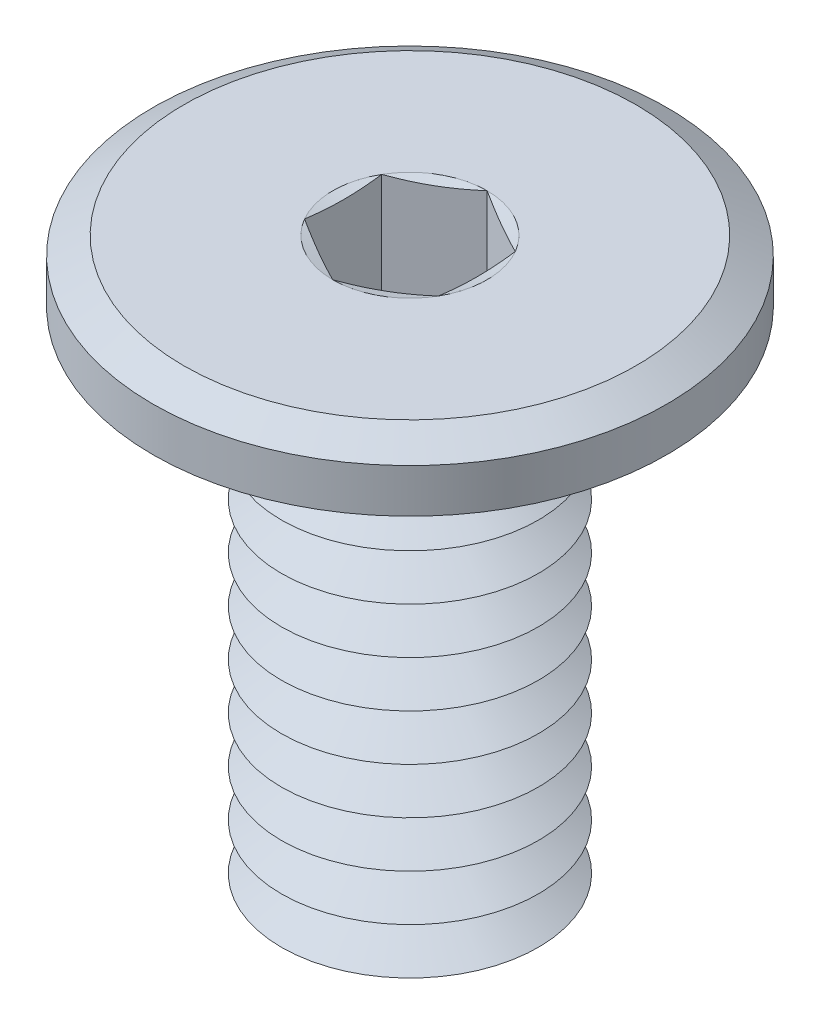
from build123d import *

# Parameters (mm, degrees)
SKETCH1_R           = 2.5
BOSS_EXTRUDE1_DEPTH = 0.6
SKETCH2_R           = 1.25
BOSS_EXTRUDE2_DEPTH = 5
LPATTERN1_COUNT     = 10
LPATTERN1_PITCH     = 0.45
FILLET1_R           = 0.1
CHAMFER2_SIZE       = 0.3
CHAMFER2_SIZE2      = 0.173205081
CUT_EXTRUDE1_DEPTH  = 1.2


with BuildPart() as part:
    # Sketch1 → Boss-Extrude1 (new body)
    with BuildSketch(Plane(origin=(0, 0, 0), x_dir=(1, 0, 0), z_dir=(0, 1, 0))):
        with Locations(Location((0, 0, 0), (0, 0, 270))):
            Circle(SKETCH1_R)
    extrude(amount=-BOSS_EXTRUDE1_DEPTH)

    # Sketch2 → Boss-Extrude2 (add)
    with BuildSketch(Plane.XZ.offset(0.6)):
        with Locations(Location((0, 0, 0), (0, 0, 270))):
            Circle(SKETCH2_R)
    extrude(amount=BOSS_EXTRUDE2_DEPTH)

    # Sketch5 → Cut-Revolve1 (revolve, cut)
    with BuildSketch(Plane(origin=(0, 0, 0), x_dir=(0, 0, -1), z_dir=(1, 0, 0))):
        Polygon((-1.25, -5.825), (-0.860288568, -5.6), (-1.25, -5.375), align=None)
    cut_revolve1 = revolve(axis=Axis((0, 0.990593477, 0), (0, -1, 0)), mode=Mode.SUBTRACT)

    # LPattern1: Cut-Revolve1 ×10
    with Locations(*[(0, i * LPATTERN1_PITCH, 0) for i in range(1, LPATTERN1_COUNT)]):
        add(cut_revolve1, mode=Mode.SUBTRACT)

    # Fillet1
    fillet1_edges = [part.edges().sort_by_distance(p)[0] for p in [
        (0, -0.6, 1.25),
    ]]
    fillet(fillet1_edges, radius=FILLET1_R)

    # Chamfer2
    chamfer2_edges = [part.edges().sort_by_distance(p)[0] for p in [
        (0, 0, -2.5),
    ]]
    chamfer2_side = [part.faces().sort_by_distance(p)[0] for p in [
        (0, 0, 0),
    ]]
    chamfer(chamfer2_edges, length=CHAMFER2_SIZE, length2=CHAMFER2_SIZE2, reference=chamfer2_side[0])

    # Sketch6 → Cut-Extrude1 (cut)
    with BuildSketch(Plane(origin=(0, 0, 0), x_dir=(1, 0, 0), z_dir=(0, 1, 0))):
        Polygon((0, 0.75055535), (-0.65, 0.375277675), (-0.65, -0.375277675), (0, -0.75055535), (0.65, -0.375277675), (0.65, 0.375277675), align=None)
    extrude(amount=-CUT_EXTRUDE1_DEPTH, mode=Mode.SUBTRACT)

    # Cut-Extrude2 cone 1 section (on through the dimple's axis) → Cut-Extrude2 (revolve, cut)
    with BuildSketch(Plane(origin=(0, -1.2, 0), x_dir=(0, 0, 1), z_dir=(1, 0, 0))):
        Polygon((0, 0), (0.65, 0), (0, 0.375277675), align=None)
    revolve(axis=Axis((0, -1.2, 0), (0, -1, 0)), mode=Mode.SUBTRACT)

    # Cut-Extrude3 cone 1 section (on through the dimple's axis) → Cut-Extrude3 (revolve, cut)
    with BuildSketch(Plane(origin=(0, 0, 0), x_dir=(0, 0, 1), z_dir=(1, 0, 0))):
        Polygon((0, 0), (0.75055535, 0), (0, 0.2011107), align=None)
    revolve(axis=Axis((0, 0, 0), (0, -1, 0)), mode=Mode.SUBTRACT)


solid = part.part
